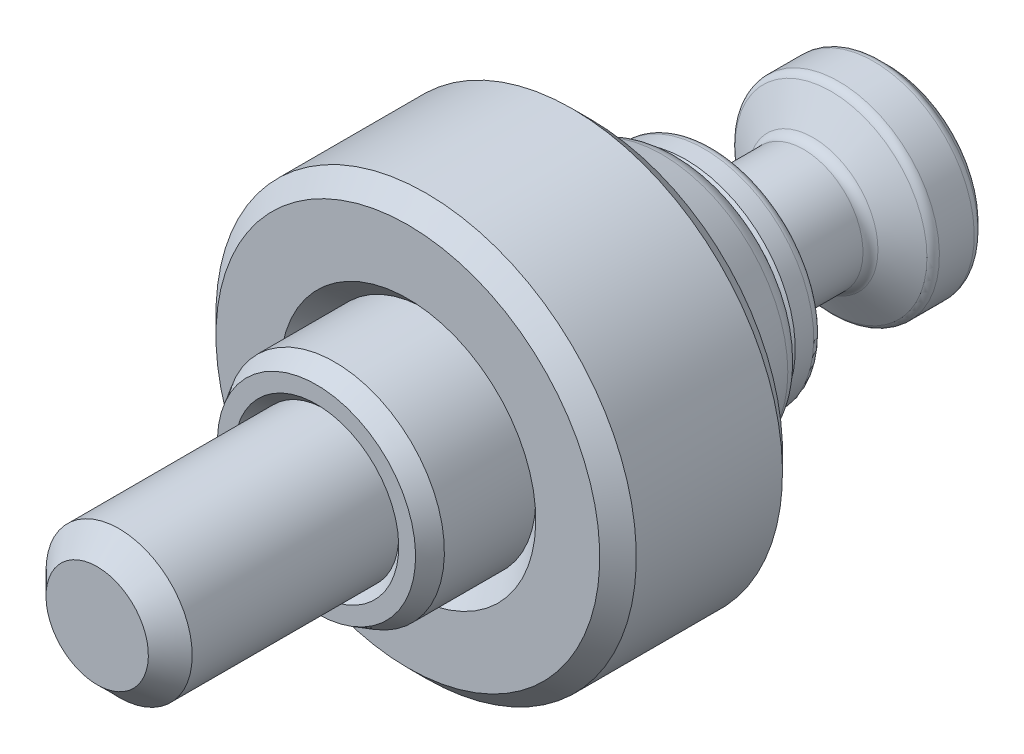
ISO-10303-21;
HEADER;
FILE_DESCRIPTION(('STEP AP214'),'2;1');
FILE_NAME('part.step','',(''),(''),'','','');
FILE_SCHEMA(('AUTOMOTIVE_DESIGN { 1 0 10303 214 1 1 1 1 }'));
ENDSEC;
DATA;
#1=APPLICATION_CONTEXT('core data for automotive mechanical design processes');
#2=APPLICATION_PROTOCOL_DEFINITION('international standard','automotive_design',2000,#1);
#3=PRODUCT_CONTEXT('',#1,'mechanical');
#4=PRODUCT('Part','Part','',(#3));
#5=PRODUCT_RELATED_PRODUCT_CATEGORY('part','',(#4));
#6=PRODUCT_DEFINITION_FORMATION('','',#4);
#7=PRODUCT_DEFINITION_CONTEXT('part definition',#1,'design');
#8=PRODUCT_DEFINITION('design','',#6,#7);
#9=PRODUCT_DEFINITION_SHAPE('','',#8);
#10=(LENGTH_UNIT() NAMED_UNIT(*) SI_UNIT(.MILLI.,.METRE.));
#11=(NAMED_UNIT(*) PLANE_ANGLE_UNIT() SI_UNIT($,.RADIAN.));
#12=(NAMED_UNIT(*) SI_UNIT($,.STERADIAN.) SOLID_ANGLE_UNIT());
#13=UNCERTAINTY_MEASURE_WITH_UNIT(LENGTH_MEASURE(1.E-05),#10,'distance_accuracy_value','');
#14=(GEOMETRIC_REPRESENTATION_CONTEXT(3) GLOBAL_UNCERTAINTY_ASSIGNED_CONTEXT((#13)) GLOBAL_UNIT_ASSIGNED_CONTEXT((#10,
#11,#12)) REPRESENTATION_CONTEXT('',''));
#15=CARTESIAN_POINT('',(0.,0.,0.));
#16=DIRECTION('',(0.,0.,1.));
#17=DIRECTION('',(1.,0.,0.));
#18=AXIS2_PLACEMENT_3D('',#15,#16,#17);
#19=CARTESIAN_POINT('',(0.,0.,0.));
#20=DIRECTION('',(0.,0.,-1.));
#21=DIRECTION('',(0.,1.,0.));
#22=AXIS2_PLACEMENT_3D('',#19,#20,#21);
#23=CYLINDRICAL_SURFACE('',#22,11.5);
#24=CARTESIAN_POINT('',(0.,0.,9.));
#25=DIRECTION('',(0.,0.,1.));
#26=DIRECTION('',(0.,-1.,0.));
#27=AXIS2_PLACEMENT_3D('',#24,#25,#26);
#28=CIRCLE('',#27,11.5);
#29=CARTESIAN_POINT('',(0.,-11.5,9.));
#30=VERTEX_POINT('',#29);
#31=EDGE_CURVE('E619',#30,#30,#28,.F.);
#32=ORIENTED_EDGE('',*,*,#31,.T.);
#33=EDGE_LOOP('',(#32));
#34=FACE_BOUND('',#33,.T.);
#35=CARTESIAN_POINT('',(0.,0.,1.));
#36=DIRECTION('',(0.,0.,-1.));
#37=DIRECTION('',(0.,1.,0.));
#38=AXIS2_PLACEMENT_3D('',#35,#36,#37);
#39=CIRCLE('',#38,11.5);
#40=CARTESIAN_POINT('',(0.,11.5,1.));
#41=VERTEX_POINT('',#40);
#42=EDGE_CURVE('E192',#41,#41,#39,.F.);
#43=ORIENTED_EDGE('',*,*,#42,.T.);
#44=EDGE_LOOP('',(#43));
#45=FACE_BOUND('',#44,.T.);
#46=ADVANCED_FACE('F15',(#34,#45),#23,.T.);
#47=CARTESIAN_POINT('',(0.,0.,0.));
#48=DIRECTION('',(0.,0.,1.));
#49=DIRECTION('',(0.,-1.,0.));
#50=AXIS2_PLACEMENT_3D('',#47,#48,#49);
#51=CONICAL_SURFACE('',#50,10.5,0.785398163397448);
#52=ORIENTED_EDGE('',*,*,#42,.F.);
#53=EDGE_LOOP('',(#52));
#54=FACE_BOUND('',#53,.T.);
#55=CARTESIAN_POINT('',(0.,0.,0.));
#56=DIRECTION('',(0.,0.,-1.));
#57=DIRECTION('',(0.,1.,0.));
#58=AXIS2_PLACEMENT_3D('',#55,#56,#57);
#59=CIRCLE('',#58,10.5);
#60=CARTESIAN_POINT('',(0.,10.5,0.));
#61=VERTEX_POINT('',#60);
#62=EDGE_CURVE('E611',#61,#61,#59,.T.);
#63=ORIENTED_EDGE('',*,*,#62,.F.);
#64=EDGE_LOOP('',(#63));
#65=FACE_BOUND('',#64,.T.);
#66=ADVANCED_FACE('F481',(#54,#65),#51,.T.);
#67=CARTESIAN_POINT('',(11.5,0.,0.));
#68=DIRECTION('',(0.,0.,-1.));
#69=DIRECTION('',(0.,1.,0.));
#70=AXIS2_PLACEMENT_3D('',#67,#68,#69);
#71=PLANE('',#70);
#72=CARTESIAN_POINT('',(0.,0.,0.));
#73=DIRECTION('',(0.,0.,1.));
#74=DIRECTION('',(0.,-1.,0.));
#75=AXIS2_PLACEMENT_3D('',#72,#73,#74);
#76=CIRCLE('',#75,7.55);
#77=CARTESIAN_POINT('',(0.,-7.55,0.));
#78=VERTEX_POINT('',#77);
#79=EDGE_CURVE('E186',#78,#78,#76,.T.);
#80=ORIENTED_EDGE('',*,*,#79,.T.);
#81=EDGE_LOOP('',(#80));
#82=FACE_BOUND('',#81,.T.);
#83=ORIENTED_EDGE('',*,*,#62,.T.);
#84=EDGE_LOOP('',(#83));
#85=FACE_BOUND('',#84,.T.);
#86=ADVANCED_FACE('F472',(#82,#85),#71,.T.);
#87=CARTESIAN_POINT('',(0.,0.,9.));
#88=DIRECTION('',(0.,0.,-1.));
#89=DIRECTION('',(0.,1.,0.));
#90=AXIS2_PLACEMENT_3D('',#87,#88,#89);
#91=CONICAL_SURFACE('',#90,11.5,0.785398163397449);
#92=CARTESIAN_POINT('',(0.,0.,10.));
#93=DIRECTION('',(0.,0.,1.));
#94=DIRECTION('',(0.,-1.,0.));
#95=AXIS2_PLACEMENT_3D('',#92,#93,#94);
#96=CIRCLE('',#95,10.5);
#97=CARTESIAN_POINT('',(0.,-10.5,10.));
#98=VERTEX_POINT('',#97);
#99=EDGE_CURVE('E616',#98,#98,#96,.T.);
#100=ORIENTED_EDGE('',*,*,#99,.F.);
#101=EDGE_LOOP('',(#100));
#102=FACE_BOUND('',#101,.T.);
#103=ORIENTED_EDGE('',*,*,#31,.F.);
#104=EDGE_LOOP('',(#103));
#105=FACE_BOUND('',#104,.T.);
#106=ADVANCED_FACE('F463',(#102,#105),#91,.T.);
#107=CARTESIAN_POINT('',(6.,0.,10.));
#108=DIRECTION('',(0.,0.,1.));
#109=DIRECTION('',(0.,-1.,0.));
#110=AXIS2_PLACEMENT_3D('',#107,#108,#109);
#111=PLANE('',#110);
#112=CARTESIAN_POINT('',(0.,0.,10.));
#113=DIRECTION('',(0.,0.,1.));
#114=DIRECTION('',(0.,-1.,0.));
#115=AXIS2_PLACEMENT_3D('',#112,#113,#114);
#116=CIRCLE('',#115,7.);
#117=CARTESIAN_POINT('',(0.,-7.,10.));
#118=VERTEX_POINT('',#117);
#119=EDGE_CURVE('E608',#118,#118,#116,.F.);
#120=ORIENTED_EDGE('',*,*,#119,.T.);
#121=EDGE_LOOP('',(#120));
#122=FACE_BOUND('',#121,.T.);
#123=ORIENTED_EDGE('',*,*,#99,.T.);
#124=EDGE_LOOP('',(#123));
#125=FACE_BOUND('',#124,.T.);
#126=ADVANCED_FACE('F278',(#122,#125),#111,.T.);
#127=CARTESIAN_POINT('',(0.,0.,10.));
#128=DIRECTION('',(0.,0.,1.));
#129=DIRECTION('',(0.,-1.,0.));
#130=AXIS2_PLACEMENT_3D('',#127,#128,#129);
#131=CONICAL_SURFACE('',#130,7.,0.785398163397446);
#132=CARTESIAN_POINT('',(0.,0.,9.));
#133=DIRECTION('',(0.,0.,1.));
#134=DIRECTION('',(0.,-1.,0.));
#135=AXIS2_PLACEMENT_3D('',#132,#133,#134);
#136=CIRCLE('',#135,6.);
#137=CARTESIAN_POINT('',(0.,-6.,9.));
#138=VERTEX_POINT('',#137);
#139=EDGE_CURVE('E189',#138,#138,#136,.T.);
#140=ORIENTED_EDGE('',*,*,#139,.F.);
#141=EDGE_LOOP('',(#140));
#142=FACE_BOUND('',#141,.T.);
#143=ORIENTED_EDGE('',*,*,#119,.F.);
#144=EDGE_LOOP('',(#143));
#145=FACE_BOUND('',#144,.T.);
#146=ADVANCED_FACE('F268',(#142,#145),#131,.F.);
#147=CARTESIAN_POINT('',(0.,0.,27.));
#148=DIRECTION('',(0.,0.,1.));
#149=DIRECTION('',(0.,1.,0.));
#150=AXIS2_PLACEMENT_3D('',#147,#148,#149);
#151=PLANE('',#150);
#152=CARTESIAN_POINT('',(0.,0.,27.));
#153=DIRECTION('',(0.,0.,1.));
#154=DIRECTION('',(0.,1.,0.));
#155=AXIS2_PLACEMENT_3D('',#152,#153,#154);
#156=CIRCLE('',#155,2.8);
#157=CARTESIAN_POINT('',(0.,2.8,27.));
#158=VERTEX_POINT('',#157);
#159=EDGE_CURVE('E145',#158,#158,#156,.T.);
#160=ORIENTED_EDGE('',*,*,#159,.T.);
#161=EDGE_LOOP('',(#160));
#162=FACE_BOUND('',#161,.T.);
#163=ADVANCED_FACE('F265',(#162),#151,.T.);
#164=CARTESIAN_POINT('',(0.,0.,25.8));
#165=DIRECTION('',(0.,0.,-1.));
#166=DIRECTION('',(0.,-1.,0.));
#167=AXIS2_PLACEMENT_3D('',#164,#165,#166);
#168=CONICAL_SURFACE('',#167,4.,0.785398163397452);
#169=ORIENTED_EDGE('',*,*,#159,.F.);
#170=EDGE_LOOP('',(#169));
#171=FACE_BOUND('',#170,.T.);
#172=CARTESIAN_POINT('',(0.,0.,25.8));
#173=DIRECTION('',(0.,0.,1.));
#174=DIRECTION('',(0.,1.,0.));
#175=AXIS2_PLACEMENT_3D('',#172,#173,#174);
#176=CIRCLE('',#175,4.);
#177=CARTESIAN_POINT('',(0.,4.,25.8));
#178=VERTEX_POINT('',#177);
#179=EDGE_CURVE('E142',#178,#178,#176,.F.);
#180=ORIENTED_EDGE('',*,*,#179,.F.);
#181=EDGE_LOOP('',(#180));
#182=FACE_BOUND('',#181,.T.);
#183=ADVANCED_FACE('F267',(#171,#182),#168,.T.);
#184=CARTESIAN_POINT('',(0.,0.,-5.));
#185=DIRECTION('',(0.,0.,-1.));
#186=DIRECTION('',(0.,-1.,0.));
#187=AXIS2_PLACEMENT_3D('',#184,#185,#186);
#188=CYLINDRICAL_SURFACE('',#187,4.);
#189=ORIENTED_EDGE('',*,*,#179,.T.);
#190=EDGE_LOOP('',(#189));
#191=FACE_BOUND('',#190,.T.);
#192=CARTESIAN_POINT('',(0.,0.,14.5));
#193=DIRECTION('',(0.,0.,1.));
#194=DIRECTION('',(0.,-1.,0.));
#195=AXIS2_PLACEMENT_3D('',#192,#193,#194);
#196=CIRCLE('',#195,4.);
#197=CARTESIAN_POINT('',(0.,-4.,14.5));
#198=VERTEX_POINT('',#197);
#199=EDGE_CURVE('E179',#198,#198,#196,.T.);
#200=ORIENTED_EDGE('',*,*,#199,.T.);
#201=EDGE_LOOP('',(#200));
#202=FACE_BOUND('',#201,.T.);
#203=ADVANCED_FACE('F276',(#191,#202),#188,.T.);
#204=CARTESIAN_POINT('',(0.,0.,15.));
#205=DIRECTION('',(0.,0.,1.));
#206=DIRECTION('',(0.,-1.,0.));
#207=AXIS2_PLACEMENT_3D('',#204,#205,#206);
#208=CONICAL_SURFACE('',#207,4.5,0.785398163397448);
#209=ORIENTED_EDGE('',*,*,#199,.F.);
#210=EDGE_LOOP('',(#209));
#211=FACE_BOUND('',#210,.T.);
#212=CARTESIAN_POINT('',(0.,0.,15.));
#213=DIRECTION('',(0.,0.,1.));
#214=DIRECTION('',(0.,-1.,0.));
#215=AXIS2_PLACEMENT_3D('',#212,#213,#214);
#216=CIRCLE('',#215,4.5);
#217=CARTESIAN_POINT('',(0.,-4.5,15.));
#218=VERTEX_POINT('',#217);
#219=EDGE_CURVE('E176',#218,#218,#216,.F.);
#220=ORIENTED_EDGE('',*,*,#219,.F.);
#221=EDGE_LOOP('',(#220));
#222=FACE_BOUND('',#221,.T.);
#223=ADVANCED_FACE('F300',(#211,#222),#208,.F.);
#224=CARTESIAN_POINT('',(4.,0.,15.));
#225=DIRECTION('',(0.,0.,1.));
#226=DIRECTION('',(0.,-1.,0.));
#227=AXIS2_PLACEMENT_3D('',#224,#225,#226);
#228=PLANE('',#227);
#229=ORIENTED_EDGE('',*,*,#219,.T.);
#230=EDGE_LOOP('',(#229));
#231=FACE_BOUND('',#230,.T.);
#232=CARTESIAN_POINT('',(0.,0.,15.));
#233=DIRECTION('',(0.,0.,1.));
#234=DIRECTION('',(0.,-1.,0.));
#235=AXIS2_PLACEMENT_3D('',#232,#233,#234);
#236=CIRCLE('',#235,5.42264973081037);
#237=CARTESIAN_POINT('',(0.,-5.42264973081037,15.));
#238=VERTEX_POINT('',#237);
#239=EDGE_CURVE('E173',#238,#238,#236,.T.);
#240=ORIENTED_EDGE('',*,*,#239,.T.);
#241=EDGE_LOOP('',(#240));
#242=FACE_BOUND('',#241,.T.);
#243=ADVANCED_FACE('F583',(#231,#242),#228,.T.);
#244=CARTESIAN_POINT('',(0.,0.,14.));
#245=DIRECTION('',(0.,0.,-1.));
#246=DIRECTION('',(0.,1.,0.));
#247=AXIS2_PLACEMENT_3D('',#244,#245,#246);
#248=CONICAL_SURFACE('',#247,6.,0.523598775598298);
#249=ORIENTED_EDGE('',*,*,#239,.F.);
#250=EDGE_LOOP('',(#249));
#251=FACE_BOUND('',#250,.T.);
#252=CARTESIAN_POINT('',(0.,0.,14.));
#253=DIRECTION('',(0.,0.,1.));
#254=DIRECTION('',(0.,-1.,0.));
#255=AXIS2_PLACEMENT_3D('',#252,#253,#254);
#256=CIRCLE('',#255,6.);
#257=CARTESIAN_POINT('',(0.,-6.,14.));
#258=VERTEX_POINT('',#257);
#259=EDGE_CURVE('E170',#258,#258,#256,.F.);
#260=ORIENTED_EDGE('',*,*,#259,.F.);
#261=EDGE_LOOP('',(#260));
#262=FACE_BOUND('',#261,.T.);
#263=ADVANCED_FACE('F585',(#251,#262),#248,.T.);
#264=CARTESIAN_POINT('',(0.,0.,0.));
#265=DIRECTION('',(0.,0.,-1.));
#266=DIRECTION('',(0.,1.,0.));
#267=AXIS2_PLACEMENT_3D('',#264,#265,#266);
#268=CYLINDRICAL_SURFACE('',#267,6.);
#269=ORIENTED_EDGE('',*,*,#259,.T.);
#270=EDGE_LOOP('',(#269));
#271=FACE_BOUND('',#270,.T.);
#272=ORIENTED_EDGE('',*,*,#139,.T.);
#273=EDGE_LOOP('',(#272));
#274=FACE_BOUND('',#273,.T.);
#275=ADVANCED_FACE('F500',(#271,#274),#268,.T.);
#276=CARTESIAN_POINT('',(-1.73205080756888,0.,-14.));
#277=DIRECTION('',(0.,0.,-1.));
#278=DIRECTION('',(0.,-1.,0.));
#279=AXIS2_PLACEMENT_3D('',#276,#277,#278);
#280=PLANE('',#279);
#281=DIRECTION('',(0.5,-0.866025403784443,0.));
#282=VECTOR('',#281,1.);
#283=CARTESIAN_POINT('',(0.866025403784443,1.5,-14.));
#284=LINE('',#283,#282);
#285=CARTESIAN_POINT('',(0.866025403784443,1.5,-14.));
#286=VERTEX_POINT('',#285);
#287=CARTESIAN_POINT('',(1.73205080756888,0.,-14.));
#288=VERTEX_POINT('',#287);
#289=EDGE_CURVE('E689',#286,#288,#284,.T.);
#290=ORIENTED_EDGE('',*,*,#289,.T.);
#291=DIRECTION('',(-0.5,-0.866025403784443,0.));
#292=VECTOR('',#291,1.);
#293=CARTESIAN_POINT('',(1.73205080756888,0.,-14.));
#294=LINE('',#293,#292);
#295=CARTESIAN_POINT('',(0.866025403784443,-1.5,-14.));
#296=VERTEX_POINT('',#295);
#297=EDGE_CURVE('E690',#288,#296,#294,.T.);
#298=ORIENTED_EDGE('',*,*,#297,.T.);
#299=DIRECTION('',(-1.,0.,0.));
#300=VECTOR('',#299,1.);
#301=CARTESIAN_POINT('',(0.866025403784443,-1.5,-14.));
#302=LINE('',#301,#300);
#303=CARTESIAN_POINT('',(-0.866025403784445,-1.5,-14.));
#304=VERTEX_POINT('',#303);
#305=EDGE_CURVE('E41',#296,#304,#302,.T.);
#306=ORIENTED_EDGE('',*,*,#305,.T.);
#307=DIRECTION('',(-0.5,0.866025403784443,0.));
#308=VECTOR('',#307,1.);
#309=CARTESIAN_POINT('',(-0.866025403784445,-1.5,-14.));
#310=LINE('',#309,#308);
#311=CARTESIAN_POINT('',(-1.73205080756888,0.,-14.));
#312=VERTEX_POINT('',#311);
#313=EDGE_CURVE('E89',#304,#312,#310,.T.);
#314=ORIENTED_EDGE('',*,*,#313,.T.);
#315=DIRECTION('',(0.5,0.866025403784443,0.));
#316=VECTOR('',#315,1.);
#317=CARTESIAN_POINT('',(-1.73205080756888,0.,-14.));
#318=LINE('',#317,#316);
#319=CARTESIAN_POINT('',(-0.866025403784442,1.5,-14.));
#320=VERTEX_POINT('',#319);
#321=EDGE_CURVE('E693',#312,#320,#318,.T.);
#322=ORIENTED_EDGE('',*,*,#321,.T.);
#323=DIRECTION('',(1.,0.,0.));
#324=VECTOR('',#323,1.);
#325=CARTESIAN_POINT('',(-0.866025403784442,1.5,-14.));
#326=LINE('',#325,#324);
#327=EDGE_CURVE('E691',#320,#286,#326,.T.);
#328=ORIENTED_EDGE('',*,*,#327,.T.);
#329=EDGE_LOOP('',(#290,#298,#306,#314,#322,#328));
#330=FACE_BOUND('',#329,.T.);
#331=ADVANCED_FACE('F254',(#330),#280,.T.);
#332=CARTESIAN_POINT('',(-0.866025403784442,1.5,-14.));
#333=DIRECTION('',(0.,1.,0.));
#334=DIRECTION('',(-1.,0.,0.));
#335=AXIS2_PLACEMENT_3D('',#332,#333,#334);
#336=PLANE('',#335);
#337=CARTESIAN_POINT('',(2.29543900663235,1.5,-16.9284440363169));
#338=CARTESIAN_POINT('',(2.23016907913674,1.5,-16.8969074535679));
#339=CARTESIAN_POINT('',(2.16474594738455,1.5,-16.8656823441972));
#340=CARTESIAN_POINT('',(2.03351166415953,1.5,-16.8040309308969));
#341=CARTESIAN_POINT('',(1.96770045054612,1.5,-16.773604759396));
#342=CARTESIAN_POINT('',(1.83525433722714,1.5,-16.7135673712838));
#343=CARTESIAN_POINT('',(1.76861688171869,1.5,-16.6839617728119));
#344=CARTESIAN_POINT('',(1.63480095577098,1.5,-16.6260043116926));
#345=CARTESIAN_POINT('',(1.56762251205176,1.5,-16.5976523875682));
#346=CARTESIAN_POINT('',(1.43058681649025,1.5,-16.5417052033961));
#347=CARTESIAN_POINT('',(1.36070972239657,1.5,-16.5141582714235));
#348=CARTESIAN_POINT('',(1.22012618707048,1.5,-16.4612246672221));
#349=CARTESIAN_POINT('',(1.14941964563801,1.5,-16.4358382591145));
#350=CARTESIAN_POINT('',(1.00721111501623,1.5,-16.3879160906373));
#351=CARTESIAN_POINT('',(0.935711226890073,1.5,-16.3653741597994));
#352=CARTESIAN_POINT('',(0.791680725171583,1.5,-16.3238812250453));
#353=CARTESIAN_POINT('',(0.719150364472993,1.5,-16.3049293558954));
#354=CARTESIAN_POINT('',(0.573415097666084,1.5,-16.2716463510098));
#355=CARTESIAN_POINT('',(0.500215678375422,1.5,-16.2572916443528));
#356=CARTESIAN_POINT('',(0.352940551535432,1.5,-16.234036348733));
#357=CARTESIAN_POINT('',(0.278864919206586,1.5,-16.2251352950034));
#358=CARTESIAN_POINT('',(0.131159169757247,1.5,-16.2136168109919));
#359=CARTESIAN_POINT('',(0.0575353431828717,1.5,-16.2109210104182));
#360=CARTESIAN_POINT('',(-0.0896707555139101,1.5,-16.2118280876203));
#361=CARTESIAN_POINT('',(-0.163253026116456,1.5,-16.2154311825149));
#362=CARTESIAN_POINT('',(-0.341649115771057,1.5,-16.2314857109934));
#363=CARTESIAN_POINT('',(-0.446180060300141,1.5,-16.2470947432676));
#364=CARTESIAN_POINT('',(-0.653280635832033,1.5,-16.2882095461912));
#365=CARTESIAN_POINT('',(-0.755848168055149,1.5,-16.3137253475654));
#366=CARTESIAN_POINT('',(-0.961126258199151,1.5,-16.3725352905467));
#367=CARTESIAN_POINT('',(-1.06378994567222,1.5,-16.4059887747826));
#368=CARTESIAN_POINT('',(-1.26721758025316,1.5,-16.4780546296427));
#369=CARTESIAN_POINT('',(-1.36798209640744,1.5,-16.516665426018));
#370=CARTESIAN_POINT('',(-1.60568963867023,1.5,-16.6126473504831));
#371=CARTESIAN_POINT('',(-1.74198279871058,1.5,-16.671611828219));
#372=CARTESIAN_POINT('',(-2.01269156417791,1.5,-16.7937291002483));
#373=CARTESIAN_POINT('',(-2.14710666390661,1.5,-16.8568829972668));
#374=CARTESIAN_POINT('',(-2.41474388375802,1.5,-16.9859892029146));
#375=CARTESIAN_POINT('',(-2.54796469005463,1.5,-17.0519442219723));
#376=CARTESIAN_POINT('',(-2.81346836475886,1.5,-17.1857175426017));
#377=CARTESIAN_POINT('',(-2.94575120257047,1.5,-17.253535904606));
#378=CARTESIAN_POINT('',(-3.19854913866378,1.5,-17.3847374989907));
#379=CARTESIAN_POINT('',(-3.31911936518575,1.5,-17.4480147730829));
#380=CARTESIAN_POINT('',(-3.55982498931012,1.5,-17.5753998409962));
#381=CARTESIAN_POINT('',(-3.67996037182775,1.5,-17.6395076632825));
#382=CARTESIAN_POINT('',(-3.91960483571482,1.5,-17.7682016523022));
#383=CARTESIAN_POINT('',(-4.03911472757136,1.5,-17.8327863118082));
#384=CARTESIAN_POINT('',(-4.27785704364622,1.5,-17.9624516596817));
#385=CARTESIAN_POINT('',(-4.39708948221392,1.5,-18.0275323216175));
#386=CARTESIAN_POINT('',(-4.51621992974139,1.5,-18.0927978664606));
#387=B_SPLINE_CURVE_WITH_KNOTS('',3,(#337,#338,#339,#340,#341,#342,#343,#344,#345,#346,#347,
#348,#349,#350,#351,#352,#353,#354,#355,#356,#357,#358,#359,#360,#361,#362,#363,#364,#365,#366,
#367,#368,#369,#370,#371,#372,#373,#374,#375,#376,#377,#378,#379,#380,#381,#382,#383,#384,#385,
#386),.UNSPECIFIED.,.F.,.F.,(4,2,2,2,2,2,2,2,2,2,2,2,2,2,2,2,2,2,2,2,2,2,2,2,4),(0.,
0.217471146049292,0.434978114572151,0.653721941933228,0.87245503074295,1.09776002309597,
1.32309251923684,1.54792748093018,1.77270818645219,1.99631720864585,2.21990717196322,
2.44065739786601,2.66141523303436,2.97783093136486,3.29456784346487,3.61830004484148,
3.9419336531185,4.38731314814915,4.83281034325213,5.2787488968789,5.72470193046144,
6.13319601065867,6.54170412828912,6.94923706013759,7.35674842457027),.UNSPECIFIED.);
#388=CARTESIAN_POINT('',(0.866025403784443,1.5,-16.3452994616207));
#389=VERTEX_POINT('',#388);
#390=CARTESIAN_POINT('',(-0.866025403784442,1.5,-16.3452994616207));
#391=VERTEX_POINT('',#390);
#392=EDGE_CURVE('E239',#389,#391,#387,.T.);
#393=ORIENTED_EDGE('',*,*,#392,.F.);
#394=DIRECTION('',(0.,0.,-1.));
#395=VECTOR('',#394,1.);
#396=CARTESIAN_POINT('',(0.866025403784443,1.5,-14.));
#397=LINE('',#396,#395);
#398=EDGE_CURVE('E102',#286,#389,#397,.T.);
#399=ORIENTED_EDGE('',*,*,#398,.F.);
#400=ORIENTED_EDGE('',*,*,#327,.F.);
#401=DIRECTION('',(0.,0.,-1.));
#402=VECTOR('',#401,1.);
#403=CARTESIAN_POINT('',(-0.866025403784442,1.5,-14.));
#404=LINE('',#403,#402);
#405=EDGE_CURVE('E105',#320,#391,#404,.T.);
#406=ORIENTED_EDGE('',*,*,#405,.T.);
#407=EDGE_LOOP('',(#393,#399,#400,#406));
#408=FACE_BOUND('',#407,.T.);
#409=ADVANCED_FACE('F250',(#408),#336,.F.);
#410=CARTESIAN_POINT('',(0.866025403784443,1.5,-14.));
#411=DIRECTION('',(0.866025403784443,0.5,0.));
#412=DIRECTION('',(-0.5,0.866025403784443,0.));
#413=AXIS2_PLACEMENT_3D('',#410,#411,#412);
#414=PLANE('',#413);
#415=CARTESIAN_POINT('',(1.73216627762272,-0.000199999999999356,-16.3453661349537));
#416=CARTESIAN_POINT('',(1.69410775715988,0.0657192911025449,-16.3233823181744));
#417=CARTESIAN_POINT('',(1.65572072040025,0.132207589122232,-16.303388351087));
#418=CARTESIAN_POINT('',(1.5782818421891,0.266335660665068,-16.2684875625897));
#419=CARTESIAN_POINT('',(1.53922862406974,0.333977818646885,-16.2535930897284));
#420=CARTESIAN_POINT('',(1.4616062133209,0.468423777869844,-16.2304061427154));
#421=CARTESIAN_POINT('',(1.42304896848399,0.535206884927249,-16.221959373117));
#422=CARTESIAN_POINT('',(1.34575291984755,0.669087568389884,-16.211873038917));
#423=CARTESIAN_POINT('',(1.30701439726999,0.736184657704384,-16.2102251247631));
#424=CARTESIAN_POINT('',(1.23462040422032,0.8615747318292,-16.2136410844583));
#425=CARTESIAN_POINT('',(1.20095413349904,0.919886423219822,-16.2178662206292));
#426=CARTESIAN_POINT('',(1.13384094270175,1.03612987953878,-16.2312612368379));
#427=CARTESIAN_POINT('',(1.10039425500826,1.09406124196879,-16.240435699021));
#428=CARTESIAN_POINT('',(1.03314252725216,1.21054465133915,-16.2633726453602));
#429=CARTESIAN_POINT('',(0.999346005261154,1.26908194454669,-16.2772324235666));
#430=CARTESIAN_POINT('',(0.932257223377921,1.38528312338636,-16.3086892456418));
#431=CARTESIAN_POINT('',(0.898964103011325,1.44294849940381,-16.3262788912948));
#432=CARTESIAN_POINT('',(0.865909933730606,1.5002,-16.3453661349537));
#433=B_SPLINE_CURVE_WITH_KNOTS('',3,(#415,#416,#417,#418,#419,#420,#421,#422,#423,#424,#425,
#426,#427,#428,#429,#430,#431,#432),.UNSPECIFIED.,.F.,.F.,(4,2,2,2,2,2,2,2,4),(0.,
0.237777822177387,0.476127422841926,0.708577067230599,0.94074115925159,1.14294352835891,
1.34533342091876,1.55221450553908,1.75868901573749),.UNSPECIFIED.);
#434=CARTESIAN_POINT('',(1.73205080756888,0.,-16.3452994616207));
#435=VERTEX_POINT('',#434);
#436=EDGE_CURVE('E232',#435,#389,#433,.T.);
#437=ORIENTED_EDGE('',*,*,#436,.F.);
#438=DIRECTION('',(0.,0.,-1.));
#439=VECTOR('',#438,1.);
#440=CARTESIAN_POINT('',(1.73205080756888,0.,-14.));
#441=LINE('',#440,#439);
#442=EDGE_CURVE('E95',#288,#435,#441,.T.);
#443=ORIENTED_EDGE('',*,*,#442,.F.);
#444=ORIENTED_EDGE('',*,*,#289,.F.);
#445=ORIENTED_EDGE('',*,*,#398,.T.);
#446=EDGE_LOOP('',(#437,#443,#444,#445));
#447=FACE_BOUND('',#446,.T.);
#448=ADVANCED_FACE('F253',(#447),#414,.F.);
#449=CARTESIAN_POINT('',(1.73205080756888,0.,-14.));
#450=DIRECTION('',(0.866025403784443,-0.5,0.));
#451=DIRECTION('',(0.5,0.866025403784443,0.));
#452=AXIS2_PLACEMENT_3D('',#449,#450,#451);
#453=PLANE('',#452);
#454=CARTESIAN_POINT('',(0.865909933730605,-1.5002,-16.3453661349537));
#455=CARTESIAN_POINT('',(0.903968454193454,-1.43428070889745,-16.3233823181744));
#456=CARTESIAN_POINT('',(0.942355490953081,-1.36779241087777,-16.303388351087));
#457=CARTESIAN_POINT('',(1.01979436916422,-1.23366433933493,-16.2684875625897));
#458=CARTESIAN_POINT('',(1.05884758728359,-1.16602218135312,-16.2535930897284));
#459=CARTESIAN_POINT('',(1.13646999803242,-1.03157622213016,-16.2304061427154));
#460=CARTESIAN_POINT('',(1.17502724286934,-0.964793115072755,-16.221959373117));
#461=CARTESIAN_POINT('',(1.25232329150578,-0.830912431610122,-16.211873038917));
#462=CARTESIAN_POINT('',(1.29106181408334,-0.763815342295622,-16.2102251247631));
#463=CARTESIAN_POINT('',(1.36345580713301,-0.638425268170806,-16.2136410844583));
#464=CARTESIAN_POINT('',(1.39712207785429,-0.580113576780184,-16.2178662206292));
#465=CARTESIAN_POINT('',(1.46423526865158,-0.463870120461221,-16.2312612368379));
#466=CARTESIAN_POINT('',(1.49768195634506,-0.405938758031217,-16.240435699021));
#467=CARTESIAN_POINT('',(1.56493368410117,-0.289455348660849,-16.2633726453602));
#468=CARTESIAN_POINT('',(1.59873020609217,-0.230918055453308,-16.2772324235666));
#469=CARTESIAN_POINT('',(1.66581898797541,-0.114716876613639,-16.3086892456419));
#470=CARTESIAN_POINT('',(1.699112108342,-0.0570515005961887,-16.3262788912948));
#471=CARTESIAN_POINT('',(1.73216627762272,0.00020000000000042,-16.3453661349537));
#472=B_SPLINE_CURVE_WITH_KNOTS('',3,(#454,#455,#456,#457,#458,#459,#460,#461,#462,#463,#464,
#465,#466,#467,#468,#469,#470,#471),.UNSPECIFIED.,.F.,.F.,(4,2,2,2,2,2,2,2,4),(0.,
0.237777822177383,0.476127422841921,0.708577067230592,0.94074115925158,1.14294352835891,
1.34533342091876,1.55221450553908,1.75868901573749),.UNSPECIFIED.);
#473=CARTESIAN_POINT('',(0.866025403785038,-1.5,-16.3452994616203));
#474=VERTEX_POINT('',#473);
#475=EDGE_CURVE('E86',#474,#435,#472,.T.);
#476=ORIENTED_EDGE('',*,*,#475,.F.);
#477=DIRECTION('',(0.,0.,-1.));
#478=VECTOR('',#477,1.);
#479=CARTESIAN_POINT('',(0.866025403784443,-1.5,-14.));
#480=LINE('',#479,#478);
#481=EDGE_CURVE('E85',#296,#474,#480,.T.);
#482=ORIENTED_EDGE('',*,*,#481,.F.);
#483=ORIENTED_EDGE('',*,*,#297,.F.);
#484=ORIENTED_EDGE('',*,*,#442,.T.);
#485=EDGE_LOOP('',(#476,#482,#483,#484));
#486=FACE_BOUND('',#485,.T.);
#487=ADVANCED_FACE('F663',(#486),#453,.F.);
#488=CARTESIAN_POINT('',(0.866025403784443,-1.5,-14.));
#489=DIRECTION('',(0.,-1.,0.));
#490=DIRECTION('',(1.,0.,0.));
#491=AXIS2_PLACEMENT_3D('',#488,#489,#490);
#492=PLANE('',#491);
#493=CARTESIAN_POINT('',(2.29543900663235,-1.5,-16.9284440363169));
#494=CARTESIAN_POINT('',(2.23016907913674,-1.5,-16.8969074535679));
#495=CARTESIAN_POINT('',(2.16474594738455,-1.5,-16.8656823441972));
#496=CARTESIAN_POINT('',(2.03351166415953,-1.5,-16.8040309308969));
#497=CARTESIAN_POINT('',(1.96770045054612,-1.5,-16.773604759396));
#498=CARTESIAN_POINT('',(1.83525433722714,-1.5,-16.7135673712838));
#499=CARTESIAN_POINT('',(1.7686168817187,-1.5,-16.6839617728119));
#500=CARTESIAN_POINT('',(1.63480095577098,-1.5,-16.6260043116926));
#501=CARTESIAN_POINT('',(1.56762251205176,-1.5,-16.5976523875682));
#502=CARTESIAN_POINT('',(1.43058681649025,-1.5,-16.5417052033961));
#503=CARTESIAN_POINT('',(1.36070972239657,-1.5,-16.5141582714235));
#504=CARTESIAN_POINT('',(1.22012618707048,-1.5,-16.4612246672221));
#505=CARTESIAN_POINT('',(1.14941964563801,-1.5,-16.4358382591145));
#506=CARTESIAN_POINT('',(1.00721111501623,-1.5,-16.3879160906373));
#507=CARTESIAN_POINT('',(0.935711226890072,-1.5,-16.3653741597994));
#508=CARTESIAN_POINT('',(0.791680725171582,-1.5,-16.3238812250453));
#509=CARTESIAN_POINT('',(0.719150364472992,-1.5,-16.3049293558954));
#510=CARTESIAN_POINT('',(0.573415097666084,-1.5,-16.2716463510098));
#511=CARTESIAN_POINT('',(0.500215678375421,-1.5,-16.2572916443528));
#512=CARTESIAN_POINT('',(0.352940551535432,-1.5,-16.234036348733));
#513=CARTESIAN_POINT('',(0.278864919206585,-1.5,-16.2251352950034));
#514=CARTESIAN_POINT('',(0.131159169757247,-1.5,-16.2136168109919));
#515=CARTESIAN_POINT('',(0.0575353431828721,-1.5,-16.2109210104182));
#516=CARTESIAN_POINT('',(-0.0896707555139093,-1.5,-16.2118280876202));
#517=CARTESIAN_POINT('',(-0.163253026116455,-1.5,-16.2154311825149));
#518=CARTESIAN_POINT('',(-0.341649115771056,-1.5,-16.2314857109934));
#519=CARTESIAN_POINT('',(-0.44618006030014,-1.5,-16.2470947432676));
#520=CARTESIAN_POINT('',(-0.653280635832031,-1.5,-16.2882095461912));
#521=CARTESIAN_POINT('',(-0.755848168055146,-1.5,-16.3137253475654));
#522=CARTESIAN_POINT('',(-0.961126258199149,-1.5,-16.3725352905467));
#523=CARTESIAN_POINT('',(-1.06378994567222,-1.5,-16.4059887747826));
#524=CARTESIAN_POINT('',(-1.26721758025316,-1.5,-16.4780546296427));
#525=CARTESIAN_POINT('',(-1.36798209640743,-1.5,-16.516665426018));
#526=CARTESIAN_POINT('',(-1.60568963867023,-1.5,-16.6126473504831));
#527=CARTESIAN_POINT('',(-1.74198279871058,-1.5,-16.671611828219));
#528=CARTESIAN_POINT('',(-2.01269156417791,-1.5,-16.7937291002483));
#529=CARTESIAN_POINT('',(-2.14710666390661,-1.5,-16.8568829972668));
#530=CARTESIAN_POINT('',(-2.41474388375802,-1.5,-16.9859892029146));
#531=CARTESIAN_POINT('',(-2.54796469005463,-1.5,-17.0519442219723));
#532=CARTESIAN_POINT('',(-2.81346836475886,-1.5,-17.1857175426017));
#533=CARTESIAN_POINT('',(-2.94575120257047,-1.5,-17.253535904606));
#534=CARTESIAN_POINT('',(-3.19854913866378,-1.5,-17.3847374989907));
#535=CARTESIAN_POINT('',(-3.31911936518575,-1.5,-17.4480147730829));
#536=CARTESIAN_POINT('',(-3.55982498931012,-1.5,-17.5753998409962));
#537=CARTESIAN_POINT('',(-3.67996037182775,-1.5,-17.6395076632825));
#538=CARTESIAN_POINT('',(-3.91960483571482,-1.5,-17.7682016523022));
#539=CARTESIAN_POINT('',(-4.03911472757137,-1.5,-17.8327863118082));
#540=CARTESIAN_POINT('',(-4.27785704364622,-1.5,-17.9624516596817));
#541=CARTESIAN_POINT('',(-4.39708948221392,-1.5,-18.0275323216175));
#542=CARTESIAN_POINT('',(-4.51621992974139,-1.5,-18.0927978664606));
#543=B_SPLINE_CURVE_WITH_KNOTS('',3,(#493,#494,#495,#496,#497,#498,#499,#500,#501,#502,#503,
#504,#505,#506,#507,#508,#509,#510,#511,#512,#513,#514,#515,#516,#517,#518,#519,#520,#521,#522,
#523,#524,#525,#526,#527,#528,#529,#530,#531,#532,#533,#534,#535,#536,#537,#538,#539,#540,#541,
#542),.UNSPECIFIED.,.F.,.F.,(4,2,2,2,2,2,2,2,2,2,2,2,2,2,2,2,2,2,2,2,2,2,2,2,4),(0.,
0.217471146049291,0.43497811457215,0.653721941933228,0.872455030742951,1.09776002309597,
1.32309251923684,1.54792748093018,1.77270818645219,1.99631720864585,2.21990717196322,
2.44065739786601,2.66141523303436,2.97783093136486,3.29456784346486,3.61830004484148,
3.9419336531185,4.38731314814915,4.83281034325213,5.2787488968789,5.72470193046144,
6.13319601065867,6.54170412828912,6.94923706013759,7.35674842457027),.UNSPECIFIED.);
#544=CARTESIAN_POINT('',(-0.866025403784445,-1.5,-16.3452994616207));
#545=VERTEX_POINT('',#544);
#546=EDGE_CURVE('E71',#545,#474,#543,.F.);
#547=ORIENTED_EDGE('',*,*,#546,.F.);
#548=DIRECTION('',(0.,0.,-1.));
#549=VECTOR('',#548,1.);
#550=CARTESIAN_POINT('',(-0.866025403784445,-1.5,-14.));
#551=LINE('',#550,#549);
#552=EDGE_CURVE('E82',#304,#545,#551,.T.);
#553=ORIENTED_EDGE('',*,*,#552,.F.);
#554=ORIENTED_EDGE('',*,*,#305,.F.);
#555=ORIENTED_EDGE('',*,*,#481,.T.);
#556=EDGE_LOOP('',(#547,#553,#554,#555));
#557=FACE_BOUND('',#556,.T.);
#558=ADVANCED_FACE('F81',(#557),#492,.F.);
#559=CARTESIAN_POINT('',(-0.866025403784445,-1.5,-14.));
#560=DIRECTION('',(-0.866025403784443,-0.5,0.));
#561=DIRECTION('',(0.5,-0.866025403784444,0.));
#562=AXIS2_PLACEMENT_3D('',#559,#560,#561);
#563=PLANE('',#562);
#564=CARTESIAN_POINT('',(-1.73216627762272,0.000199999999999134,-16.3453661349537));
#565=CARTESIAN_POINT('',(-1.69410775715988,-0.0657192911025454,-16.3233823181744));
#566=CARTESIAN_POINT('',(-1.65572072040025,-0.132207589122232,-16.303388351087));
#567=CARTESIAN_POINT('',(-1.57828184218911,-0.266335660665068,-16.2684875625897));
#568=CARTESIAN_POINT('',(-1.53922862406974,-0.333977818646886,-16.2535930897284));
#569=CARTESIAN_POINT('',(-1.4616062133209,-0.468423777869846,-16.2304061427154));
#570=CARTESIAN_POINT('',(-1.42304896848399,-0.53520688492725,-16.221959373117));
#571=CARTESIAN_POINT('',(-1.34575291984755,-0.669087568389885,-16.211873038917));
#572=CARTESIAN_POINT('',(-1.30701439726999,-0.736184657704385,-16.2102251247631));
#573=CARTESIAN_POINT('',(-1.23462040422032,-0.861574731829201,-16.2136410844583));
#574=CARTESIAN_POINT('',(-1.20095413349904,-0.919886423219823,-16.2178662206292));
#575=CARTESIAN_POINT('',(-1.13384094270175,-1.03612987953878,-16.2312612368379));
#576=CARTESIAN_POINT('',(-1.10039425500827,-1.09406124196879,-16.240435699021));
#577=CARTESIAN_POINT('',(-1.03314252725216,-1.21054465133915,-16.2633726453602));
#578=CARTESIAN_POINT('',(-0.999346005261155,-1.26908194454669,-16.2772324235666));
#579=CARTESIAN_POINT('',(-0.932257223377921,-1.38528312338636,-16.3086892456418));
#580=CARTESIAN_POINT('',(-0.898964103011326,-1.44294849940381,-16.3262788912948));
#581=CARTESIAN_POINT('',(-0.865909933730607,-1.5002,-16.3453661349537));
#582=B_SPLINE_CURVE_WITH_KNOTS('',3,(#564,#565,#566,#567,#568,#569,#570,#571,#572,#573,#574,
#575,#576,#577,#578,#579,#580,#581),.UNSPECIFIED.,.F.,.F.,(4,2,2,2,2,2,2,2,4),(0.,
0.237777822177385,0.476127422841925,0.708577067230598,0.94074115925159,1.14294352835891,
1.34533342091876,1.55221450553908,1.75868901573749),.UNSPECIFIED.);
#583=CARTESIAN_POINT('',(-1.73205080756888,0.,-16.3452994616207));
#584=VERTEX_POINT('',#583);
#585=EDGE_CURVE('E68',#584,#545,#582,.T.);
#586=ORIENTED_EDGE('',*,*,#585,.F.);
#587=DIRECTION('',(0.,0.,-1.));
#588=VECTOR('',#587,1.);
#589=CARTESIAN_POINT('',(-1.73205080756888,0.,-14.));
#590=LINE('',#589,#588);
#591=EDGE_CURVE('E108',#312,#584,#590,.T.);
#592=ORIENTED_EDGE('',*,*,#591,.F.);
#593=ORIENTED_EDGE('',*,*,#313,.F.);
#594=ORIENTED_EDGE('',*,*,#552,.T.);
#595=EDGE_LOOP('',(#586,#592,#593,#594));
#596=FACE_BOUND('',#595,.T.);
#597=ADVANCED_FACE('F88',(#596),#563,.F.);
#598=CARTESIAN_POINT('',(-1.73205080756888,0.,-14.));
#599=DIRECTION('',(-0.866025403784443,0.5,0.));
#600=DIRECTION('',(-0.5,-0.866025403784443,0.));
#601=AXIS2_PLACEMENT_3D('',#598,#599,#600);
#602=PLANE('',#601);
#603=CARTESIAN_POINT('',(-0.865909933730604,1.5002,-16.3453661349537));
#604=CARTESIAN_POINT('',(-0.903968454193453,1.43428070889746,-16.3233823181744));
#605=CARTESIAN_POINT('',(-0.942355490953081,1.36779241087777,-16.303388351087));
#606=CARTESIAN_POINT('',(-1.01979436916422,1.23366433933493,-16.2684875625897));
#607=CARTESIAN_POINT('',(-1.05884758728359,1.16602218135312,-16.2535930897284));
#608=CARTESIAN_POINT('',(-1.13646999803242,1.03157622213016,-16.2304061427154));
#609=CARTESIAN_POINT('',(-1.17502724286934,0.964793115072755,-16.221959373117));
#610=CARTESIAN_POINT('',(-1.25232329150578,0.830912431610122,-16.211873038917));
#611=CARTESIAN_POINT('',(-1.29106181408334,0.763815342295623,-16.2102251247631));
#612=CARTESIAN_POINT('',(-1.36345580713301,0.638425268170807,-16.2136410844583));
#613=CARTESIAN_POINT('',(-1.39712207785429,0.580113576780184,-16.2178662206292));
#614=CARTESIAN_POINT('',(-1.46423526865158,0.463870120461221,-16.2312612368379));
#615=CARTESIAN_POINT('',(-1.49768195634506,0.405938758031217,-16.240435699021));
#616=CARTESIAN_POINT('',(-1.56493368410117,0.289455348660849,-16.2633726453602));
#617=CARTESIAN_POINT('',(-1.59873020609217,0.230918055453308,-16.2772324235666));
#618=CARTESIAN_POINT('',(-1.66581898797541,0.114716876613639,-16.3086892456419));
#619=CARTESIAN_POINT('',(-1.699112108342,0.0570515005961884,-16.3262788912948));
#620=CARTESIAN_POINT('',(-1.73216627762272,-0.000200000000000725,-16.3453661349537));
#621=B_SPLINE_CURVE_WITH_KNOTS('',3,(#603,#604,#605,#606,#607,#608,#609,#610,#611,#612,#613,
#614,#615,#616,#617,#618,#619,#620),.UNSPECIFIED.,.F.,.F.,(4,2,2,2,2,2,2,2,4),(0.,
0.237777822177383,0.476127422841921,0.708577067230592,0.94074115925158,1.14294352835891,
1.34533342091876,1.55221450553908,1.75868901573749),.UNSPECIFIED.);
#622=EDGE_CURVE('E33',#391,#584,#621,.T.);
#623=ORIENTED_EDGE('',*,*,#622,.F.);
#624=ORIENTED_EDGE('',*,*,#405,.F.);
#625=ORIENTED_EDGE('',*,*,#321,.F.);
#626=ORIENTED_EDGE('',*,*,#591,.T.);
#627=EDGE_LOOP('',(#623,#624,#625,#626));
#628=FACE_BOUND('',#627,.T.);
#629=ADVANCED_FACE('F214',(#628),#602,.F.);
#630=CARTESIAN_POINT('',(0.,0.,-16.5));
#631=DIRECTION('',(0.,0.,-1.));
#632=DIRECTION('',(0.,-1.,0.));
#633=AXIS2_PLACEMENT_3D('',#630,#631,#632);
#634=CONICAL_SURFACE('',#633,2.,1.0471975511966);
#635=CARTESIAN_POINT('',(0.,0.,-16.5));
#636=DIRECTION('',(0.,0.,1.));
#637=DIRECTION('',(0.,1.,0.));
#638=AXIS2_PLACEMENT_3D('',#635,#636,#637);
#639=CIRCLE('',#638,2.);
#640=CARTESIAN_POINT('',(0.,2.,-16.5));
#641=VERTEX_POINT('',#640);
#642=EDGE_CURVE('E77',#641,#641,#639,.T.);
#643=ORIENTED_EDGE('',*,*,#642,.F.);
#644=EDGE_LOOP('',(#643));
#645=FACE_BOUND('',#644,.T.);
#646=ORIENTED_EDGE('',*,*,#622,.T.);
#647=ORIENTED_EDGE('',*,*,#585,.T.);
#648=ORIENTED_EDGE('',*,*,#546,.T.);
#649=ORIENTED_EDGE('',*,*,#475,.T.);
#650=ORIENTED_EDGE('',*,*,#436,.T.);
#651=ORIENTED_EDGE('',*,*,#392,.T.);
#652=EDGE_LOOP('',(#646,#647,#648,#649,#650,#651));
#653=FACE_BOUND('',#652,.T.);
#654=ADVANCED_FACE('F70',(#645,#653),#634,.F.);
#655=CARTESIAN_POINT('',(-6.,0.,-16.5));
#656=DIRECTION('',(0.,0.,-1.));
#657=DIRECTION('',(0.,-1.,0.));
#658=AXIS2_PLACEMENT_3D('',#655,#656,#657);
#659=PLANE('',#658);
#660=CARTESIAN_POINT('',(0.,0.,-16.5));
#661=DIRECTION('',(0.,0.,-1.));
#662=DIRECTION('',(0.,-1.,0.));
#663=AXIS2_PLACEMENT_3D('',#660,#661,#662);
#664=CIRCLE('',#663,4.28578643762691);
#665=CARTESIAN_POINT('',(0.,-4.28578643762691,-16.5));
#666=VERTEX_POINT('',#665);
#667=EDGE_CURVE('E19',#666,#666,#664,.T.);
#668=ORIENTED_EDGE('',*,*,#667,.T.);
#669=EDGE_LOOP('',(#668));
#670=FACE_BOUND('',#669,.T.);
#671=ORIENTED_EDGE('',*,*,#642,.T.);
#672=EDGE_LOOP('',(#671));
#673=FACE_BOUND('',#672,.T.);
#674=ADVANCED_FACE('F213',(#670,#673),#659,.T.);
#675=CARTESIAN_POINT('',(0.,0.,-15.5));
#676=DIRECTION('',(0.,0.,-1.));
#677=DIRECTION('',(0.,-1.,0.));
#678=AXIS2_PLACEMENT_3D('',#675,#676,#677);
#679=TOROIDAL_SURFACE('',#678,4.28578643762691,1.);
#680=ORIENTED_EDGE('',*,*,#667,.F.);
#681=EDGE_LOOP('',(#680));
#682=FACE_BOUND('',#681,.T.);
#683=CARTESIAN_POINT('',(0.,0.,-16.2071067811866));
#684=DIRECTION('',(0.,0.,-1.));
#685=DIRECTION('',(0.,-1.,0.));
#686=AXIS2_PLACEMENT_3D('',#683,#684,#685);
#687=CIRCLE('',#686,4.99289321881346);
#688=CARTESIAN_POINT('',(0.,-4.99289321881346,-16.2071067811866));
#689=VERTEX_POINT('',#688);
#690=EDGE_CURVE('E147',#689,#689,#687,.F.);
#691=ORIENTED_EDGE('',*,*,#690,.F.);
#692=EDGE_LOOP('',(#691));
#693=FACE_BOUND('',#692,.T.);
#694=ADVANCED_FACE('F17',(#682,#693),#679,.T.);
#695=CARTESIAN_POINT('',(0.,0.,-15.7));
#696=DIRECTION('',(0.,0.,1.));
#697=DIRECTION('',(0.,1.,0.));
#698=AXIS2_PLACEMENT_3D('',#695,#696,#697);
#699=CONICAL_SURFACE('',#698,5.5,0.785398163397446);
#700=ORIENTED_EDGE('',*,*,#690,.T.);
#701=EDGE_LOOP('',(#700));
#702=FACE_BOUND('',#701,.T.);
#703=CARTESIAN_POINT('',(0.,0.,-15.8464466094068));
#704=DIRECTION('',(0.,0.,-1.));
#705=DIRECTION('',(0.,-1.,0.));
#706=AXIS2_PLACEMENT_3D('',#703,#704,#705);
#707=CIRCLE('',#706,5.35355339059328);
#708=CARTESIAN_POINT('',(0.,-5.35355339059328,-15.8464466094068));
#709=VERTEX_POINT('',#708);
#710=EDGE_CURVE('E130',#709,#709,#707,.T.);
#711=ORIENTED_EDGE('',*,*,#710,.T.);
#712=EDGE_LOOP('',(#711));
#713=FACE_BOUND('',#712,.T.);
#714=ADVANCED_FACE('F218',(#702,#713),#699,.T.);
#715=CARTESIAN_POINT('',(0.,0.,-15.4928932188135));
#716=DIRECTION('',(0.,0.,-1.));
#717=DIRECTION('',(0.,-1.,0.));
#718=AXIS2_PLACEMENT_3D('',#715,#716,#717);
#719=TOROIDAL_SURFACE('',#718,5.,0.5);
#720=ORIENTED_EDGE('',*,*,#710,.F.);
#721=EDGE_LOOP('',(#720));
#722=FACE_BOUND('',#721,.T.);
#723=CARTESIAN_POINT('',(0.,0.,-15.4928932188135));
#724=DIRECTION('',(0.,0.,-1.));
#725=DIRECTION('',(0.,-1.,0.));
#726=AXIS2_PLACEMENT_3D('',#723,#724,#725);
#727=CIRCLE('',#726,5.5);
#728=CARTESIAN_POINT('',(0.,-5.5,-15.4928932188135));
#729=VERTEX_POINT('',#728);
#730=EDGE_CURVE('E127',#729,#729,#727,.F.);
#731=ORIENTED_EDGE('',*,*,#730,.F.);
#732=EDGE_LOOP('',(#731));
#733=FACE_BOUND('',#732,.T.);
#734=ADVANCED_FACE('F315',(#722,#733),#719,.T.);
#735=CARTESIAN_POINT('',(0.,0.,-5.));
#736=DIRECTION('',(0.,0.,1.));
#737=DIRECTION('',(0.,1.,0.));
#738=AXIS2_PLACEMENT_3D('',#735,#736,#737);
#739=CYLINDRICAL_SURFACE('',#738,5.5);
#740=ORIENTED_EDGE('',*,*,#730,.T.);
#741=EDGE_LOOP('',(#740));
#742=FACE_BOUND('',#741,.T.);
#743=CARTESIAN_POINT('',(0.,0.,-13.5877132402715));
#744=DIRECTION('',(0.,0.,-1.));
#745=DIRECTION('',(0.,-1.,0.));
#746=AXIS2_PLACEMENT_3D('',#743,#744,#745);
#747=CIRCLE('',#746,5.5);
#748=CARTESIAN_POINT('',(0.,-5.5,-13.5877132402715));
#749=VERTEX_POINT('',#748);
#750=EDGE_CURVE('E124',#749,#749,#747,.T.);
#751=ORIENTED_EDGE('',*,*,#750,.T.);
#752=EDGE_LOOP('',(#751));
#753=FACE_BOUND('',#752,.T.);
#754=ADVANCED_FACE('F318',(#742,#753),#739,.T.);
#755=CARTESIAN_POINT('',(0.,0.,-13.5877132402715));
#756=DIRECTION('',(0.,0.,-1.));
#757=DIRECTION('',(0.,-1.,0.));
#758=AXIS2_PLACEMENT_3D('',#755,#756,#757);
#759=TOROIDAL_SURFACE('',#758,5.,0.5);
#760=ORIENTED_EDGE('',*,*,#750,.F.);
#761=EDGE_LOOP('',(#760));
#762=FACE_BOUND('',#761,.T.);
#763=CARTESIAN_POINT('',(0.,0.,-13.1547005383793));
#764=DIRECTION('',(0.,0.,1.));
#765=DIRECTION('',(0.,1.,0.));
#766=AXIS2_PLACEMENT_3D('',#763,#764,#765);
#767=CIRCLE('',#766,5.25);
#768=CARTESIAN_POINT('',(0.,5.25,-13.1547005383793));
#769=VERTEX_POINT('',#768);
#770=EDGE_CURVE('E133',#769,#769,#767,.T.);
#771=ORIENTED_EDGE('',*,*,#770,.F.);
#772=EDGE_LOOP('',(#771));
#773=FACE_BOUND('',#772,.T.);
#774=ADVANCED_FACE('F320',(#762,#773),#759,.T.);
#775=CARTESIAN_POINT('',(0.,0.,-12.));
#776=DIRECTION('',(0.,0.,-1.));
#777=DIRECTION('',(0.,-1.,0.));
#778=AXIS2_PLACEMENT_3D('',#775,#776,#777);
#779=CONICAL_SURFACE('',#778,3.25,1.0471975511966);
#780=ORIENTED_EDGE('',*,*,#770,.T.);
#781=EDGE_LOOP('',(#780));
#782=FACE_BOUND('',#781,.T.);
#783=CARTESIAN_POINT('',(0.,0.,-12.1732050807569));
#784=DIRECTION('',(0.,0.,-1.));
#785=DIRECTION('',(0.,-1.,0.));
#786=AXIS2_PLACEMENT_3D('',#783,#784,#785);
#787=CIRCLE('',#786,3.55);
#788=CARTESIAN_POINT('',(0.,-3.55,-12.1732050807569));
#789=VERTEX_POINT('',#788);
#790=EDGE_CURVE('E118',#789,#789,#787,.T.);
#791=ORIENTED_EDGE('',*,*,#790,.T.);
#792=EDGE_LOOP('',(#791));
#793=FACE_BOUND('',#792,.T.);
#794=ADVANCED_FACE('F309',(#782,#793),#779,.T.);
#795=CARTESIAN_POINT('',(0.,0.,-11.6535898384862));
#796=DIRECTION('',(0.,0.,1.));
#797=DIRECTION('',(0.,1.,0.));
#798=AXIS2_PLACEMENT_3D('',#795,#796,#797);
#799=TOROIDAL_SURFACE('',#798,3.85,0.6);
#800=ORIENTED_EDGE('',*,*,#790,.F.);
#801=EDGE_LOOP('',(#800));
#802=FACE_BOUND('',#801,.T.);
#803=CARTESIAN_POINT('',(0.,0.,-11.6535898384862));
#804=DIRECTION('',(0.,0.,1.));
#805=DIRECTION('',(0.,1.,0.));
#806=AXIS2_PLACEMENT_3D('',#803,#804,#805);
#807=CIRCLE('',#806,3.25);
#808=CARTESIAN_POINT('',(0.,3.25,-11.6535898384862));
#809=VERTEX_POINT('',#808);
#810=EDGE_CURVE('E115',#809,#809,#807,.T.);
#811=ORIENTED_EDGE('',*,*,#810,.F.);
#812=EDGE_LOOP('',(#811));
#813=FACE_BOUND('',#812,.T.);
#814=ADVANCED_FACE('F305',(#802,#813),#799,.F.);
#815=CARTESIAN_POINT('',(0.,0.,-5.));
#816=DIRECTION('',(0.,0.,1.));
#817=DIRECTION('',(0.,1.,0.));
#818=AXIS2_PLACEMENT_3D('',#815,#816,#817);
#819=CYLINDRICAL_SURFACE('',#818,3.25);
#820=ORIENTED_EDGE('',*,*,#810,.T.);
#821=EDGE_LOOP('',(#820));
#822=FACE_BOUND('',#821,.T.);
#823=CARTESIAN_POINT('',(0.,0.,-8.43412340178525));
#824=DIRECTION('',(0.,0.,1.));
#825=DIRECTION('',(0.,1.,0.));
#826=AXIS2_PLACEMENT_3D('',#823,#824,#825);
#827=CIRCLE('',#826,3.25);
#828=CARTESIAN_POINT('',(0.,3.25,-8.43412340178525));
#829=VERTEX_POINT('',#828);
#830=EDGE_CURVE('E112',#829,#829,#827,.F.);
#831=ORIENTED_EDGE('',*,*,#830,.T.);
#832=EDGE_LOOP('',(#831));
#833=FACE_BOUND('',#832,.T.);
#834=ADVANCED_FACE('F308',(#822,#833),#819,.T.);
#835=CARTESIAN_POINT('',(0.,0.,-8.43412340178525));
#836=DIRECTION('',(0.,0.,1.));
#837=DIRECTION('',(0.,1.,0.));
#838=AXIS2_PLACEMENT_3D('',#835,#836,#837);
#839=TOROIDAL_SURFACE('',#838,3.85,0.6);
#840=ORIENTED_EDGE('',*,*,#830,.F.);
#841=EDGE_LOOP('',(#840));
#842=FACE_BOUND('',#841,.T.);
#843=CARTESIAN_POINT('',(0.,0.,-7.91450815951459));
#844=DIRECTION('',(0.,0.,1.));
#845=DIRECTION('',(0.,1.,0.));
#846=AXIS2_PLACEMENT_3D('',#843,#844,#845);
#847=CIRCLE('',#846,3.55);
#848=CARTESIAN_POINT('',(0.,3.55,-7.91450815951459));
#849=VERTEX_POINT('',#848);
#850=EDGE_CURVE('E121',#849,#849,#847,.T.);
#851=ORIENTED_EDGE('',*,*,#850,.F.);
#852=EDGE_LOOP('',(#851));
#853=FACE_BOUND('',#852,.T.);
#854=ADVANCED_FACE('F311',(#842,#853),#839,.F.);
#855=CARTESIAN_POINT('',(0.,0.,-6.5));
#856=DIRECTION('',(0.,0.,1.));
#857=DIRECTION('',(0.,1.,0.));
#858=AXIS2_PLACEMENT_3D('',#855,#856,#857);
#859=CONICAL_SURFACE('',#858,6.,1.0471975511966);
#860=CARTESIAN_POINT('',(0.,0.,-6.64433756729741));
#861=DIRECTION('',(0.,0.,-1.));
#862=DIRECTION('',(0.,-1.,0.));
#863=AXIS2_PLACEMENT_3D('',#860,#861,#862);
#864=CIRCLE('',#863,5.75);
#865=CARTESIAN_POINT('',(0.,-5.75,-6.64433756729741));
#866=VERTEX_POINT('',#865);
#867=EDGE_CURVE('E139',#866,#866,#864,.T.);
#868=ORIENTED_EDGE('',*,*,#867,.T.);
#869=EDGE_LOOP('',(#868));
#870=FACE_BOUND('',#869,.T.);
#871=ORIENTED_EDGE('',*,*,#850,.T.);
#872=EDGE_LOOP('',(#871));
#873=FACE_BOUND('',#872,.T.);
#874=ADVANCED_FACE('F283',(#870,#873),#859,.T.);
#875=CARTESIAN_POINT('',(0.,0.,-6.21132486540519));
#876=DIRECTION('',(0.,0.,-1.));
#877=DIRECTION('',(0.,-1.,0.));
#878=AXIS2_PLACEMENT_3D('',#875,#876,#877);
#879=TOROIDAL_SURFACE('',#878,5.5,0.5);
#880=ORIENTED_EDGE('',*,*,#867,.F.);
#881=EDGE_LOOP('',(#880));
#882=FACE_BOUND('',#881,.T.);
#883=CARTESIAN_POINT('',(0.,0.,-6.21132486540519));
#884=DIRECTION('',(0.,0.,-1.));
#885=DIRECTION('',(0.,-1.,0.));
#886=AXIS2_PLACEMENT_3D('',#883,#884,#885);
#887=CIRCLE('',#886,6.);
#888=CARTESIAN_POINT('',(0.,-6.,-6.21132486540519));
#889=VERTEX_POINT('',#888);
#890=EDGE_CURVE('E136',#889,#889,#887,.F.);
#891=ORIENTED_EDGE('',*,*,#890,.F.);
#892=EDGE_LOOP('',(#891));
#893=FACE_BOUND('',#892,.T.);
#894=ADVANCED_FACE('F291',(#882,#893),#879,.T.);
#895=CARTESIAN_POINT('',(0.,0.,-5.));
#896=DIRECTION('',(0.,0.,-1.));
#897=DIRECTION('',(0.,-1.,0.));
#898=AXIS2_PLACEMENT_3D('',#895,#896,#897);
#899=CYLINDRICAL_SURFACE('',#898,6.);
#900=ORIENTED_EDGE('',*,*,#890,.T.);
#901=EDGE_LOOP('',(#900));
#902=FACE_BOUND('',#901,.T.);
#903=CARTESIAN_POINT('',(0.,0.,-5.2));
#904=DIRECTION('',(0.,0.,1.));
#905=DIRECTION('',(0.,1.,0.));
#906=AXIS2_PLACEMENT_3D('',#903,#904,#905);
#907=CIRCLE('',#906,6.);
#908=CARTESIAN_POINT('',(0.,6.,-5.2));
#909=VERTEX_POINT('',#908);
#910=EDGE_CURVE('E90',#909,#909,#907,.F.);
#911=ORIENTED_EDGE('',*,*,#910,.T.);
#912=EDGE_LOOP('',(#911));
#913=FACE_BOUND('',#912,.T.);
#914=ADVANCED_FACE('F287',(#902,#913),#899,.T.);
#915=CARTESIAN_POINT('',(0.,0.,-5.2));
#916=DIRECTION('',(0.,0.,-1.));
#917=DIRECTION('',(0.,-1.,0.));
#918=AXIS2_PLACEMENT_3D('',#915,#916,#917);
#919=CONICAL_SURFACE('',#918,6.,0.785398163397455);
#920=CARTESIAN_POINT('',(0.,0.,-5.));
#921=DIRECTION('',(0.,0.,1.));
#922=DIRECTION('',(0.,1.,0.));
#923=AXIS2_PLACEMENT_3D('',#920,#921,#922);
#924=CIRCLE('',#923,5.8);
#925=CARTESIAN_POINT('',(0.,5.8,-5.));
#926=VERTEX_POINT('',#925);
#927=EDGE_CURVE('E93',#926,#926,#924,.T.);
#928=ORIENTED_EDGE('',*,*,#927,.F.);
#929=EDGE_LOOP('',(#928));
#930=FACE_BOUND('',#929,.T.);
#931=ORIENTED_EDGE('',*,*,#910,.F.);
#932=EDGE_LOOP('',(#931));
#933=FACE_BOUND('',#932,.T.);
#934=ADVANCED_FACE('F290',(#930,#933),#919,.T.);
#935=CARTESIAN_POINT('',(-4.,0.,-5.));
#936=DIRECTION('',(0.,0.,1.));
#937=DIRECTION('',(0.,1.,0.));
#938=AXIS2_PLACEMENT_3D('',#935,#936,#937);
#939=PLANE('',#938);
#940=CARTESIAN_POINT('',(0.,0.,-5.));
#941=DIRECTION('',(0.,0.,-1.));
#942=DIRECTION('',(0.,1.,0.));
#943=AXIS2_PLACEMENT_3D('',#940,#941,#942);
#944=CIRCLE('',#943,5.43594199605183);
#945=CARTESIAN_POINT('',(0.,5.43594199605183,-5.));
#946=VERTEX_POINT('',#945);
#947=EDGE_CURVE('E161',#946,#946,#944,.T.);
#948=ORIENTED_EDGE('',*,*,#947,.T.);
#949=EDGE_LOOP('',(#948));
#950=FACE_BOUND('',#949,.T.);
#951=ORIENTED_EDGE('',*,*,#927,.T.);
#952=EDGE_LOOP('',(#951));
#953=FACE_BOUND('',#952,.T.);
#954=ADVANCED_FACE('F293',(#950,#953),#939,.T.);
#955=CARTESIAN_POINT('',(0.,0.,-3.5));
#956=DIRECTION('',(0.,0.,-1.));
#957=DIRECTION('',(0.,1.,0.));
#958=AXIS2_PLACEMENT_3D('',#955,#956,#957);
#959=TOROIDAL_SURFACE('',#958,5.43594199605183,1.5);
#960=CARTESIAN_POINT('',(0.,0.,-3.91345603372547));
#961=DIRECTION('',(0.,0.,-1.));
#962=DIRECTION('',(0.,1.,0.));
#963=AXIS2_PLACEMENT_3D('',#960,#961,#962);
#964=CIRCLE('',#963,6.87783453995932);
#965=CARTESIAN_POINT('',(0.,6.87783453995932,-3.91345603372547));
#966=VERTEX_POINT('',#965);
#967=EDGE_CURVE('E167',#966,#966,#964,.F.);
#968=ORIENTED_EDGE('',*,*,#967,.F.);
#969=EDGE_LOOP('',(#968));
#970=FACE_BOUND('',#969,.T.);
#971=ORIENTED_EDGE('',*,*,#947,.F.);
#972=EDGE_LOOP('',(#971));
#973=FACE_BOUND('',#972,.T.);
#974=ADVANCED_FACE('F296',(#970,#973),#959,.T.);
#975=CARTESIAN_POINT('',(0.,0.,-5.));
#976=DIRECTION('',(0.,0.,1.));
#977=DIRECTION('',(0.,-1.,0.));
#978=AXIS2_PLACEMENT_3D('',#975,#976,#977);
#979=CONICAL_SURFACE('',#978,6.56627307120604,0.279252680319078);
#980=ORIENTED_EDGE('',*,*,#967,.T.);
#981=EDGE_LOOP('',(#980));
#982=FACE_BOUND('',#981,.T.);
#983=CARTESIAN_POINT('',(0.,0.,-0.871853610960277));
#984=DIRECTION('',(0.,0.,-1.));
#985=DIRECTION('',(0.,1.,0.));
#986=AXIS2_PLACEMENT_3D('',#983,#984,#985);
#987=CIRCLE('',#986,7.75);
#988=CARTESIAN_POINT('',(0.,7.75,-0.871853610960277));
#989=VERTEX_POINT('',#988);
#990=EDGE_CURVE('E156',#989,#989,#987,.T.);
#991=ORIENTED_EDGE('',*,*,#990,.T.);
#992=EDGE_LOOP('',(#991));
#993=FACE_BOUND('',#992,.T.);
#994=ADVANCED_FACE('F530',(#982,#993),#979,.T.);
#995=CARTESIAN_POINT('',(0.,0.,0.));
#996=DIRECTION('',(0.,0.,-1.));
#997=DIRECTION('',(0.,1.,0.));
#998=AXIS2_PLACEMENT_3D('',#995,#996,#997);
#999=CYLINDRICAL_SURFACE('',#998,7.75);
#1000=CARTESIAN_POINT('',(0.,0.,-0.2));
#1001=DIRECTION('',(0.,0.,1.));
#1002=DIRECTION('',(0.,-1.,0.));
#1003=AXIS2_PLACEMENT_3D('',#1000,#1001,#1002);
#1004=CIRCLE('',#1003,7.75);
#1005=CARTESIAN_POINT('',(0.,-7.75,-0.2));
#1006=VERTEX_POINT('',#1005);
#1007=EDGE_CURVE('E182',#1006,#1006,#1004,.F.);
#1008=ORIENTED_EDGE('',*,*,#1007,.T.);
#1009=EDGE_LOOP('',(#1008));
#1010=FACE_BOUND('',#1009,.T.);
#1011=ORIENTED_EDGE('',*,*,#990,.F.);
#1012=EDGE_LOOP('',(#1011));
#1013=FACE_BOUND('',#1012,.T.);
#1014=ADVANCED_FACE('F535',(#1010,#1013),#999,.T.);
#1015=CARTESIAN_POINT('',(0.,0.,-0.2));
#1016=DIRECTION('',(0.,0.,-1.));
#1017=DIRECTION('',(0.,1.,0.));
#1018=AXIS2_PLACEMENT_3D('',#1015,#1016,#1017);
#1019=CONICAL_SURFACE('',#1018,7.75,0.785398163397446);
#1020=ORIENTED_EDGE('',*,*,#79,.F.);
#1021=EDGE_LOOP('',(#1020));
#1022=FACE_BOUND('',#1021,.T.);
#1023=ORIENTED_EDGE('',*,*,#1007,.F.);
#1024=EDGE_LOOP('',(#1023));
#1025=FACE_BOUND('',#1024,.T.);
#1026=ADVANCED_FACE('F547',(#1022,#1025),#1019,.T.);
#1027=CLOSED_SHELL('',(#46,#66,#86,#106,#126,#146,#163,#183,#203,#223,#243,#263,#275,#331,#409,
#448,#487,#558,#597,#629,#654,#674,#694,#714,#734,#754,#774,#794,#814,#834,#854,#874,#894,#914,
#934,#954,#974,#994,#1014,#1026));
#1028=CARTESIAN_POINT('',(0.,0.,0.1));
#1029=DIRECTION('',(0.,0.,-1.));
#1030=DIRECTION('',(0.,1.,0.));
#1031=AXIS2_PLACEMENT_3D('',#1028,#1029,#1030);
#1032=TOROIDAL_SURFACE('',#1031,6.1,0.4);
#1033=CARTESIAN_POINT('',(0.,0.,-0.3));
#1034=DIRECTION('',(0.,0.,-1.));
#1035=DIRECTION('',(0.,1.,0.));
#1036=AXIS2_PLACEMENT_3D('',#1033,#1034,#1035);
#1037=CIRCLE('',#1036,6.1);
#1038=CARTESIAN_POINT('',(0.,6.1,-0.3));
#1039=VERTEX_POINT('',#1038);
#1040=EDGE_CURVE('E185',#1039,#1039,#1037,.T.);
#1041=ORIENTED_EDGE('',*,*,#1040,.F.);
#1042=EDGE_LOOP('',(#1041));
#1043=FACE_BOUND('',#1042,.T.);
#1044=CARTESIAN_POINT('',(0.,0.,0.));
#1045=DIRECTION('',(0.,0.,1.));
#1046=DIRECTION('',(1.,0.,0.));
#1047=AXIS2_PLACEMENT_3D('',#1044,#1045,#1046);
#1048=CIRCLE('',#1047,5.71270166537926);
#1049=CARTESIAN_POINT('',(5.71270166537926,0.,0.));
#1050=VERTEX_POINT('',#1049);
#1051=EDGE_CURVE('E9',#1050,#1050,#1048,.T.);
#1052=ORIENTED_EDGE('',*,*,#1051,.F.);
#1053=EDGE_LOOP('',(#1052));
#1054=FACE_BOUND('',#1053,.T.);
#1055=ADVANCED_FACE('F216',(#1043,#1054),#1032,.F.);
#1056=CARTESIAN_POINT('',(0.,0.,-0.3));
#1057=DIRECTION('',(0.,0.,1.));
#1058=DIRECTION('',(0.,-1.,0.));
#1059=AXIS2_PLACEMENT_3D('',#1056,#1057,#1058);
#1060=CONICAL_SURFACE('',#1059,6.2,0.785398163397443);
#1061=CARTESIAN_POINT('',(0.,0.,0.));
#1062=DIRECTION('',(0.,0.,1.));
#1063=DIRECTION('',(0.,-1.,0.));
#1064=AXIS2_PLACEMENT_3D('',#1061,#1062,#1063);
#1065=CIRCLE('',#1064,6.5);
#1066=CARTESIAN_POINT('',(0.,-6.5,0.));
#1067=VERTEX_POINT('',#1066);
#1068=EDGE_CURVE('E25',#1067,#1067,#1065,.T.);
#1069=ORIENTED_EDGE('',*,*,#1068,.T.);
#1070=EDGE_LOOP('',(#1069));
#1071=FACE_BOUND('',#1070,.T.);
#1072=CARTESIAN_POINT('',(0.,0.,-0.3));
#1073=DIRECTION('',(0.,0.,-1.));
#1074=DIRECTION('',(0.,1.,0.));
#1075=AXIS2_PLACEMENT_3D('',#1072,#1073,#1074);
#1076=CIRCLE('',#1075,6.2);
#1077=CARTESIAN_POINT('',(0.,6.2,-0.3));
#1078=VERTEX_POINT('',#1077);
#1079=EDGE_CURVE('E152',#1078,#1078,#1076,.T.);
#1080=ORIENTED_EDGE('',*,*,#1079,.T.);
#1081=EDGE_LOOP('',(#1080));
#1082=FACE_BOUND('',#1081,.T.);
#1083=ADVANCED_FACE('F510',(#1071,#1082),#1060,.F.);
#1084=CARTESIAN_POINT('',(6.2,0.,-0.3));
#1085=DIRECTION('',(0.,0.,-1.));
#1086=DIRECTION('',(0.,1.,0.));
#1087=AXIS2_PLACEMENT_3D('',#1084,#1085,#1086);
#1088=PLANE('',#1087);
#1089=ORIENTED_EDGE('',*,*,#1040,.T.);
#1090=EDGE_LOOP('',(#1089));
#1091=FACE_BOUND('',#1090,.T.);
#1092=ORIENTED_EDGE('',*,*,#1079,.F.);
#1093=EDGE_LOOP('',(#1092));
#1094=FACE_BOUND('',#1093,.T.);
#1095=ADVANCED_FACE('F505',(#1091,#1094),#1088,.F.);
#1096=ORIENTED_EDGE('',*,*,#1051,.T.);
#1097=EDGE_LOOP('',(#1096));
#1098=FACE_BOUND('',#1097,.T.);
#1099=ORIENTED_EDGE('',*,*,#1068,.F.);
#1100=EDGE_LOOP('',(#1099));
#1101=FACE_BOUND('',#1100,.T.);
#1102=ADVANCED_FACE('F484',(#1098,#1101),#71,.T.);
#1103=CLOSED_SHELL('',(#1055,#1083,#1095,#1102));
#1104=ORIENTED_CLOSED_SHELL('',*,#1103,.T.);
#1105=BREP_WITH_VOIDS('B1',#1027,(#1104));
#1106=ADVANCED_BREP_SHAPE_REPRESENTATION('',(#18,#1105),#14);
#1107=SHAPE_DEFINITION_REPRESENTATION(#9,#1106);
ENDSEC;
END-ISO-10303-21;
